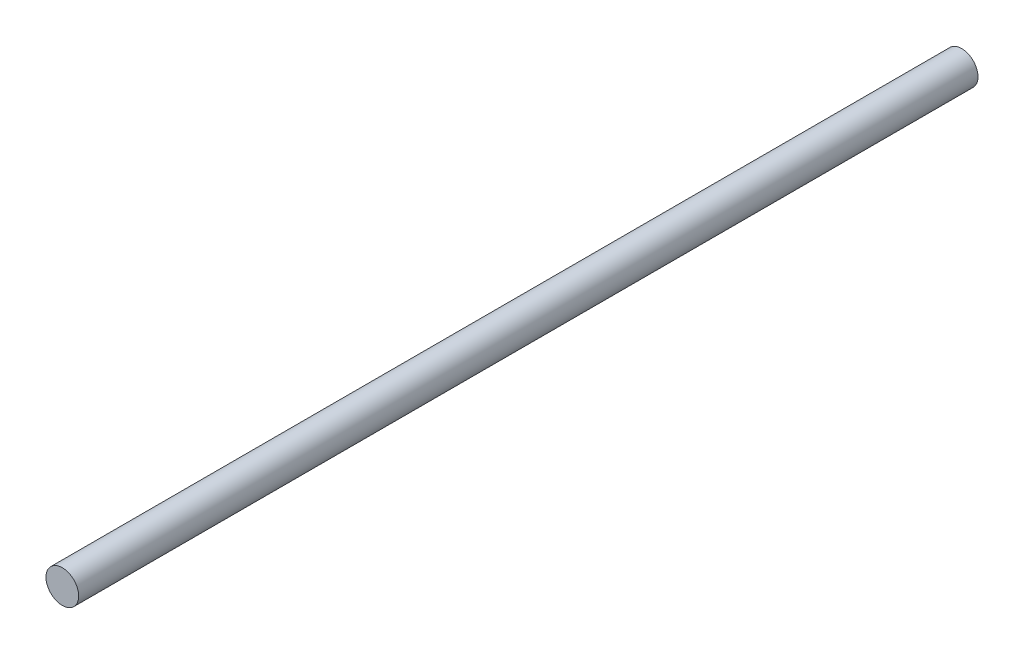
ISO-10303-21;
HEADER;
FILE_DESCRIPTION(('STEP AP214'),'2;1');
FILE_NAME('part.step','',(''),(''),'','','');
FILE_SCHEMA(('AUTOMOTIVE_DESIGN { 1 0 10303 214 1 1 1 1 }'));
ENDSEC;
DATA;
#1=APPLICATION_CONTEXT('core data for automotive mechanical design processes');
#2=APPLICATION_PROTOCOL_DEFINITION('international standard','automotive_design',2000,#1);
#3=PRODUCT_CONTEXT('',#1,'mechanical');
#4=PRODUCT('Part','Part','',(#3));
#5=PRODUCT_RELATED_PRODUCT_CATEGORY('part','',(#4));
#6=PRODUCT_DEFINITION_FORMATION('','',#4);
#7=PRODUCT_DEFINITION_CONTEXT('part definition',#1,'design');
#8=PRODUCT_DEFINITION('design','',#6,#7);
#9=PRODUCT_DEFINITION_SHAPE('','',#8);
#10=(LENGTH_UNIT() NAMED_UNIT(*) SI_UNIT(.MILLI.,.METRE.));
#11=(NAMED_UNIT(*) PLANE_ANGLE_UNIT() SI_UNIT($,.RADIAN.));
#12=(NAMED_UNIT(*) SI_UNIT($,.STERADIAN.) SOLID_ANGLE_UNIT());
#13=UNCERTAINTY_MEASURE_WITH_UNIT(LENGTH_MEASURE(1.E-05),#10,'distance_accuracy_value','');
#14=(GEOMETRIC_REPRESENTATION_CONTEXT(3) GLOBAL_UNCERTAINTY_ASSIGNED_CONTEXT((#13)) GLOBAL_UNIT_ASSIGNED_CONTEXT((#10,
#11,#12)) REPRESENTATION_CONTEXT('',''));
#15=CARTESIAN_POINT('',(0.,0.,0.));
#16=DIRECTION('',(0.,0.,1.));
#17=DIRECTION('',(1.,0.,0.));
#18=AXIS2_PLACEMENT_3D('',#15,#16,#17);
#19=CARTESIAN_POINT('',(0.,0.,-1650.));
#20=DIRECTION('',(0.,0.,1.));
#21=DIRECTION('',(1.,0.,0.));
#22=AXIS2_PLACEMENT_3D('',#19,#20,#21);
#23=CYLINDRICAL_SURFACE('',#22,30.);
#24=CARTESIAN_POINT('',(0.,0.,-1650.));
#25=DIRECTION('',(0.,0.,1.));
#26=DIRECTION('',(1.,0.,0.));
#27=AXIS2_PLACEMENT_3D('',#24,#25,#26);
#28=CIRCLE('',#27,30.);
#29=CARTESIAN_POINT('',(30.,0.,-1650.));
#30=VERTEX_POINT('',#29);
#31=EDGE_CURVE('E10',#30,#30,#28,.T.);
#32=ORIENTED_EDGE('',*,*,#31,.T.);
#33=EDGE_LOOP('',(#32));
#34=FACE_BOUND('',#33,.T.);
#35=CARTESIAN_POINT('',(0.,0.,0.));
#36=DIRECTION('',(0.,0.,1.));
#37=DIRECTION('',(1.,0.,0.));
#38=AXIS2_PLACEMENT_3D('',#35,#36,#37);
#39=CIRCLE('',#38,30.);
#40=CARTESIAN_POINT('',(30.,0.,0.));
#41=VERTEX_POINT('',#40);
#42=EDGE_CURVE('E40',#41,#41,#39,.T.);
#43=ORIENTED_EDGE('',*,*,#42,.F.);
#44=EDGE_LOOP('',(#43));
#45=FACE_BOUND('',#44,.T.);
#46=ADVANCED_FACE('F37',(#34,#45),#23,.T.);
#47=CARTESIAN_POINT('',(0.,0.,-1650.));
#48=DIRECTION('',(0.,0.,1.));
#49=DIRECTION('',(1.,0.,0.));
#50=AXIS2_PLACEMENT_3D('',#47,#48,#49);
#51=PLANE('',#50);
#52=ORIENTED_EDGE('',*,*,#31,.F.);
#53=EDGE_LOOP('',(#52));
#54=FACE_BOUND('',#53,.T.);
#55=ADVANCED_FACE('F54',(#54),#51,.F.);
#56=CARTESIAN_POINT('',(0.,0.,0.));
#57=DIRECTION('',(0.,0.,1.));
#58=DIRECTION('',(1.,0.,0.));
#59=AXIS2_PLACEMENT_3D('',#56,#57,#58);
#60=PLANE('',#59);
#61=ORIENTED_EDGE('',*,*,#42,.T.);
#62=EDGE_LOOP('',(#61));
#63=FACE_BOUND('',#62,.T.);
#64=ADVANCED_FACE('F51',(#63),#60,.T.);
#65=CLOSED_SHELL('',(#46,#55,#64));
#66=MANIFOLD_SOLID_BREP('B2',#65);
#67=ADVANCED_BREP_SHAPE_REPRESENTATION('',(#18,#66),#14);
#68=SHAPE_DEFINITION_REPRESENTATION(#9,#67);
ENDSEC;
END-ISO-10303-21;
